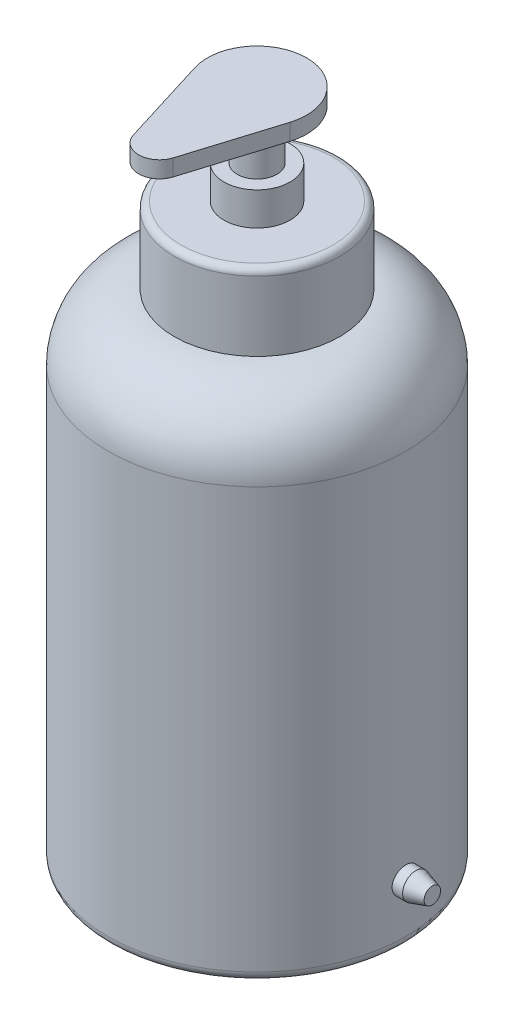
ISO-10303-21;
HEADER;
FILE_DESCRIPTION(('STEP AP214'),'2;1');
FILE_NAME('part.step','',(''),(''),'','','');
FILE_SCHEMA(('AUTOMOTIVE_DESIGN { 1 0 10303 214 1 1 1 1 }'));
ENDSEC;
DATA;
#1=APPLICATION_CONTEXT('core data for automotive mechanical design processes');
#2=APPLICATION_PROTOCOL_DEFINITION('international standard','automotive_design',2000,#1);
#3=PRODUCT_CONTEXT('',#1,'mechanical');
#4=PRODUCT('Part','Part','',(#3));
#5=PRODUCT_RELATED_PRODUCT_CATEGORY('part','',(#4));
#6=PRODUCT_DEFINITION_FORMATION('','',#4);
#7=PRODUCT_DEFINITION_CONTEXT('part definition',#1,'design');
#8=PRODUCT_DEFINITION('design','',#6,#7);
#9=PRODUCT_DEFINITION_SHAPE('','',#8);
#10=(LENGTH_UNIT() NAMED_UNIT(*) SI_UNIT(.MILLI.,.METRE.));
#11=(NAMED_UNIT(*) PLANE_ANGLE_UNIT() SI_UNIT($,.RADIAN.));
#12=(NAMED_UNIT(*) SI_UNIT($,.STERADIAN.) SOLID_ANGLE_UNIT());
#13=UNCERTAINTY_MEASURE_WITH_UNIT(LENGTH_MEASURE(1.E-05),#10,'distance_accuracy_value','');
#14=(GEOMETRIC_REPRESENTATION_CONTEXT(3) GLOBAL_UNCERTAINTY_ASSIGNED_CONTEXT((#13)) GLOBAL_UNIT_ASSIGNED_CONTEXT((#10,
#11,#12)) REPRESENTATION_CONTEXT('',''));
#15=CARTESIAN_POINT('',(0.,0.,0.));
#16=DIRECTION('',(0.,0.,1.));
#17=DIRECTION('',(1.,0.,0.));
#18=AXIS2_PLACEMENT_3D('',#15,#16,#17);
#19=CARTESIAN_POINT('',(0.,150.,0.));
#20=DIRECTION('',(0.,-1.,0.));
#21=DIRECTION('',(0.,0.,-1.));
#22=AXIS2_PLACEMENT_3D('',#19,#20,#21);
#23=CYLINDRICAL_SURFACE('',#22,45.);
#24=CARTESIAN_POINT('',(44.8218696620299,17.7484494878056,-4.));
#25=CARTESIAN_POINT('',(44.8218720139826,17.5242444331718,-3.99999023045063));
#26=CARTESIAN_POINT('',(44.8235700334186,17.2998881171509,-3.98108609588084));
#27=CARTESIAN_POINT('',(44.8301783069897,16.8573871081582,-3.90595443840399));
#28=CARTESIAN_POINT('',(44.8350921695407,16.6392496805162,-3.8496849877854));
#29=CARTESIAN_POINT('',(44.8475712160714,16.2156591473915,-3.70146645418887));
#30=CARTESIAN_POINT('',(44.8551348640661,16.0101987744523,-3.60953803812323));
#31=CARTESIAN_POINT('',(44.8720593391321,15.6176719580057,-3.39264879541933));
#32=CARTESIAN_POINT('',(44.8814197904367,15.4306016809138,-3.26769487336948));
#33=CARTESIAN_POINT('',(44.90091365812,15.0795749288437,-2.98791064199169));
#34=CARTESIAN_POINT('',(44.9110490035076,14.9156792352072,-2.83300420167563));
#35=CARTESIAN_POINT('',(44.9309330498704,14.6161766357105,-2.49787384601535));
#36=CARTESIAN_POINT('',(44.9406817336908,14.4805709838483,-2.31764880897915));
#37=CARTESIAN_POINT('',(44.9587126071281,14.241292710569,-1.93663104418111));
#38=CARTESIAN_POINT('',(44.9669923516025,14.1376731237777,-1.73580488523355));
#39=CARTESIAN_POINT('',(44.9811315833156,13.9656475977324,-1.31951843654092));
#40=CARTESIAN_POINT('',(44.9869911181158,13.8972409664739,-1.10405843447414));
#41=CARTESIAN_POINT('',(44.9956162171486,13.7977593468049,-0.665228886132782));
#42=CARTESIAN_POINT('',(44.9983899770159,13.7665854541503,-0.441881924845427));
#43=CARTESIAN_POINT('',(45.0005588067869,13.7421483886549,0.00689018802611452));
#44=CARTESIAN_POINT('',(44.9999539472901,13.7488844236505,0.232315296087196));
#45=CARTESIAN_POINT('',(44.9954404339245,13.7999953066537,0.678173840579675));
#46=CARTESIAN_POINT('',(44.9915411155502,13.8442638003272,0.898619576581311));
#47=CARTESIAN_POINT('',(44.9808878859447,13.9690175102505,1.3289395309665));
#48=CARTESIAN_POINT('',(44.9741339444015,14.0495031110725,1.53881363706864));
#49=CARTESIAN_POINT('',(44.9585150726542,14.2445242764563,1.94237021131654));
#50=CARTESIAN_POINT('',(44.9496472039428,14.3591072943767,2.13602962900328));
#51=CARTESIAN_POINT('',(44.930796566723,14.619036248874,2.50140798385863));
#52=CARTESIAN_POINT('',(44.92081377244,14.7643828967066,2.67312641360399));
#53=CARTESIAN_POINT('',(44.9008139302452,15.0823122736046,2.99037052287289));
#54=CARTESIAN_POINT('',(44.8907968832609,15.254987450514,3.13580357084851));
#55=CARTESIAN_POINT('',(44.8718921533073,15.6223506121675,3.3956324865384));
#56=CARTESIAN_POINT('',(44.8630044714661,15.8170386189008,3.51002832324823));
#57=CARTESIAN_POINT('',(44.8473634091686,16.2229679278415,3.70453297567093));
#58=CARTESIAN_POINT('',(44.8406103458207,16.4342116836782,3.7846366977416));
#59=CARTESIAN_POINT('',(44.8300094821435,16.8672237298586,3.90821321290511));
#60=CARTESIAN_POINT('',(44.8261616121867,17.0889917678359,3.95168688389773));
#61=CARTESIAN_POINT('',(44.8218183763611,17.5359458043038,4.00065138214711));
#62=CARTESIAN_POINT('',(44.8213115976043,17.7611175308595,4.00627151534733));
#63=CARTESIAN_POINT('',(44.8236778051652,18.2091997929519,3.97970839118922));
#64=CARTESIAN_POINT('',(44.8265507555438,18.4321103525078,3.94752553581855));
#65=CARTESIAN_POINT('',(44.8353423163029,18.8689696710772,3.84637790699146));
#66=CARTESIAN_POINT('',(44.8412559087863,19.0829325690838,3.77747372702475));
#67=CARTESIAN_POINT('',(44.8554583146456,19.4962613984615,3.60490106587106));
#68=CARTESIAN_POINT('',(44.8637471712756,19.6956270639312,3.50123195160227));
#69=CARTESIAN_POINT('',(44.8817938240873,20.074693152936,3.26174603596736));
#70=CARTESIAN_POINT('',(44.8915555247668,20.2543390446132,3.12584321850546));
#71=CARTESIAN_POINT('',(44.9114349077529,20.5883143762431,2.82587161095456));
#72=CARTESIAN_POINT('',(44.9215525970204,20.7426433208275,2.66180226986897));
#73=CARTESIAN_POINT('',(44.9410380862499,21.0220467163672,2.30959548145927));
#74=CARTESIAN_POINT('',(44.9504036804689,21.1470370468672,2.12139116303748));
#75=CARTESIAN_POINT('',(44.9672978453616,21.3636374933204,1.72658912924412));
#76=CARTESIAN_POINT('',(44.9748264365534,21.455247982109,1.51999161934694));
#77=CARTESIAN_POINT('',(44.9871882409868,21.6023443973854,1.09456672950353));
#78=CARTESIAN_POINT('',(44.9920253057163,21.6578819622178,0.875757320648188));
#79=CARTESIAN_POINT('',(44.9984747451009,21.7314247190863,0.431874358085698));
#80=CARTESIAN_POINT('',(45.0000871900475,21.7494307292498,0.206800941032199));
#81=CARTESIAN_POINT('',(44.9999057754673,21.7473891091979,-0.24239277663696));
#82=CARTESIAN_POINT('',(44.9981236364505,21.7274724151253,-0.466513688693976));
#83=CARTESIAN_POINT('',(44.9913764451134,21.6504242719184,-0.908213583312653));
#84=CARTESIAN_POINT('',(44.9864113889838,21.5932927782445,-1.12579255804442));
#85=CARTESIAN_POINT('',(44.9738551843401,21.4434710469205,-1.54823774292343));
#86=CARTESIAN_POINT('',(44.9662642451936,21.3507836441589,-1.7531049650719));
#87=CARTESIAN_POINT('',(44.9493045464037,21.1324957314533,-2.14439280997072));
#88=CARTESIAN_POINT('',(44.9399358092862,21.0068956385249,-2.33081366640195));
#89=CARTESIAN_POINT('',(44.9204328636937,20.7258559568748,-2.68058760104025));
#90=CARTESIAN_POINT('',(44.9102962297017,20.5703192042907,-2.84386247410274));
#91=CARTESIAN_POINT('',(44.8904206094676,20.2340033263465,-3.14205894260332));
#92=CARTESIAN_POINT('',(44.8806817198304,20.0532181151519,-3.27697368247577));
#93=CARTESIAN_POINT('',(44.8626824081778,19.6711393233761,-3.51482985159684));
#94=CARTESIAN_POINT('',(44.8544251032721,19.4698038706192,-3.6177041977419));
#95=CARTESIAN_POINT('',(44.8403615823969,19.0527783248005,-3.78805310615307));
#96=CARTESIAN_POINT('',(44.8345525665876,18.8371049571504,-3.85556812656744));
#97=CARTESIAN_POINT('',(44.827528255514,18.4748873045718,-3.93619868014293));
#98=CARTESIAN_POINT('',(44.8254161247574,18.3306684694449,-3.96009209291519));
#99=CARTESIAN_POINT('',(44.822586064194,18.0404709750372,-3.9919959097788));
#100=CARTESIAN_POINT('',(44.8218681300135,17.8944923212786,-4.00000636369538));
#101=CARTESIAN_POINT('',(44.8218696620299,17.7484494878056,-4.));
#102=B_SPLINE_CURVE_WITH_KNOTS('',3,(#24,#25,#26,#27,#28,#29,#30,#31,#32,#33,#34,#35,#36,#37,
#38,#39,#40,#41,#42,#43,#44,#45,#46,#47,#48,#49,#50,#51,#52,#53,#54,#55,#56,#57,#58,#59,#60,#61,
#62,#63,#64,#65,#66,#67,#68,#69,#70,#71,#72,#73,#74,#75,#76,#77,#78,#79,#80,#81,#82,#83,#84,#85,
#86,#87,#88,#89,#90,#91,#92,#93,#94,#95,#96,#97,#98,#99,#100,#101),.UNSPECIFIED.,.T.,.F.,(4,2,2,
2,2,2,2,2,2,2,2,2,2,2,2,2,2,2,2,2,2,2,2,2,2,2,2,2,2,2,2,2,2,2,2,2,2,2,4),(0.,0.672081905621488,
1.34491923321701,2.01736718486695,2.68967465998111,3.36371396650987,4.03778314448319,
4.7129640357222,5.38813165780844,6.06150176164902,6.73485779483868,7.40631211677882,
8.07777356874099,8.75017389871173,9.42258977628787,10.097330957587,10.7720728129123,
11.4469148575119,12.1217407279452,12.7942602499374,13.4667726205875,14.1381787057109,
14.8095970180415,15.4828275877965,16.1560713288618,16.8312224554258,17.5063660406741,
18.1805410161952,18.8547012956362,19.526538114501,20.1983757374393,20.8701598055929,
21.5419353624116,22.2159291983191,22.8900857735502,23.5656444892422,24.2404285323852,
24.6782110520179,25.1159921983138),.UNSPECIFIED.);
#103=CARTESIAN_POINT('',(44.8218696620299,17.7484494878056,-4.));
#104=VERTEX_POINT('',#103);
#105=EDGE_CURVE('E122',#104,#104,#102,.T.);
#106=ORIENTED_EDGE('',*,*,#105,.T.);
#107=EDGE_LOOP('',(#106));
#108=FACE_BOUND('',#107,.T.);
#109=CARTESIAN_POINT('',(0.,130.,0.));
#110=DIRECTION('',(0.,1.,0.));
#111=DIRECTION('',(0.,0.,1.));
#112=AXIS2_PLACEMENT_3D('',#109,#110,#111);
#113=CIRCLE('',#112,45.);
#114=CARTESIAN_POINT('',(0.,130.,45.));
#115=VERTEX_POINT('',#114);
#116=EDGE_CURVE('E159',#115,#115,#113,.F.);
#117=ORIENTED_EDGE('',*,*,#116,.T.);
#118=EDGE_LOOP('',(#117));
#119=FACE_BOUND('',#118,.T.);
#120=CARTESIAN_POINT('',(0.,3.,0.));
#121=DIRECTION('',(0.,1.,0.));
#122=DIRECTION('',(0.,0.,1.));
#123=AXIS2_PLACEMENT_3D('',#120,#121,#122);
#124=CIRCLE('',#123,45.);
#125=CARTESIAN_POINT('',(0.,3.,45.));
#126=VERTEX_POINT('',#125);
#127=EDGE_CURVE('E144',#126,#126,#124,.T.);
#128=ORIENTED_EDGE('',*,*,#127,.T.);
#129=EDGE_LOOP('',(#128));
#130=FACE_BOUND('',#129,.T.);
#131=ADVANCED_FACE('F43',(#108,#119,#130),#23,.T.);
#132=CARTESIAN_POINT('',(0.,0.,0.));
#133=DIRECTION('',(0.,1.,0.));
#134=DIRECTION('',(0.,0.,1.));
#135=AXIS2_PLACEMENT_3D('',#132,#133,#134);
#136=PLANE('',#135);
#137=CARTESIAN_POINT('',(0.,0.,0.));
#138=DIRECTION('',(0.,1.,0.));
#139=DIRECTION('',(0.,0.,1.));
#140=AXIS2_PLACEMENT_3D('',#137,#138,#139);
#141=CIRCLE('',#140,42.);
#142=CARTESIAN_POINT('',(0.,0.,42.));
#143=VERTEX_POINT('',#142);
#144=EDGE_CURVE('E151',#143,#143,#141,.F.);
#145=ORIENTED_EDGE('',*,*,#144,.T.);
#146=EDGE_LOOP('',(#145));
#147=FACE_BOUND('',#146,.T.);
#148=ADVANCED_FACE('F228',(#147),#136,.F.);
#149=CARTESIAN_POINT('',(0.,3.,0.));
#150=DIRECTION('',(0.,1.,0.));
#151=DIRECTION('',(0.,0.,1.));
#152=AXIS2_PLACEMENT_3D('',#149,#150,#151);
#153=TOROIDAL_SURFACE('',#152,42.,3.);
#154=ORIENTED_EDGE('',*,*,#144,.F.);
#155=EDGE_LOOP('',(#154));
#156=FACE_BOUND('',#155,.T.);
#157=ORIENTED_EDGE('',*,*,#127,.F.);
#158=EDGE_LOOP('',(#157));
#159=FACE_BOUND('',#158,.T.);
#160=ADVANCED_FACE('F230',(#156,#159),#153,.T.);
#161=CARTESIAN_POINT('',(0.,130.,0.));
#162=DIRECTION('',(0.,1.,0.));
#163=DIRECTION('',(0.,0.,1.));
#164=AXIS2_PLACEMENT_3D('',#161,#162,#163);
#165=TOROIDAL_SURFACE('',#164,25.,20.);
#166=ORIENTED_EDGE('',*,*,#116,.F.);
#167=EDGE_LOOP('',(#166));
#168=FACE_BOUND('',#167,.T.);
#169=CARTESIAN_POINT('',(0.,150.,0.));
#170=DIRECTION('',(0.,1.,0.));
#171=DIRECTION('',(0.,0.,1.));
#172=AXIS2_PLACEMENT_3D('',#169,#170,#171);
#173=CIRCLE('',#172,25.);
#174=CARTESIAN_POINT('',(0.,150.,25.));
#175=VERTEX_POINT('',#174);
#176=EDGE_CURVE('E155',#175,#175,#173,.T.);
#177=ORIENTED_EDGE('',*,*,#176,.F.);
#178=EDGE_LOOP('',(#177));
#179=FACE_BOUND('',#178,.T.);
#180=ADVANCED_FACE('F226',(#168,#179),#165,.T.);
#181=CARTESIAN_POINT('',(0.,173.,0.));
#182=DIRECTION('',(0.,-1.,0.));
#183=DIRECTION('',(0.,0.,-1.));
#184=AXIS2_PLACEMENT_3D('',#181,#182,#183);
#185=CYLINDRICAL_SURFACE('',#184,25.);
#186=CARTESIAN_POINT('',(0.,171.,0.));
#187=DIRECTION('',(0.,1.,0.));
#188=DIRECTION('',(0.,0.,1.));
#189=AXIS2_PLACEMENT_3D('',#186,#187,#188);
#190=CIRCLE('',#189,25.);
#191=CARTESIAN_POINT('',(0.,171.,25.));
#192=VERTEX_POINT('',#191);
#193=EDGE_CURVE('E54',#192,#192,#190,.F.);
#194=ORIENTED_EDGE('',*,*,#193,.T.);
#195=EDGE_LOOP('',(#194));
#196=FACE_BOUND('',#195,.T.);
#197=ORIENTED_EDGE('',*,*,#176,.T.);
#198=EDGE_LOOP('',(#197));
#199=FACE_BOUND('',#198,.T.);
#200=ADVANCED_FACE('F223',(#196,#199),#185,.T.);
#201=CARTESIAN_POINT('',(0.,173.,0.));
#202=DIRECTION('',(0.,1.,0.));
#203=DIRECTION('',(0.,0.,1.));
#204=AXIS2_PLACEMENT_3D('',#201,#202,#203);
#205=PLANE('',#204);
#206=CARTESIAN_POINT('',(0.,173.,0.));
#207=DIRECTION('',(0.,1.,0.));
#208=DIRECTION('',(0.,0.,1.));
#209=AXIS2_PLACEMENT_3D('',#206,#207,#208);
#210=CIRCLE('',#209,10.);
#211=CARTESIAN_POINT('',(0.,173.,10.));
#212=VERTEX_POINT('',#211);
#213=EDGE_CURVE('E138',#212,#212,#210,.T.);
#214=ORIENTED_EDGE('',*,*,#213,.F.);
#215=EDGE_LOOP('',(#214));
#216=FACE_BOUND('',#215,.T.);
#217=CARTESIAN_POINT('',(0.,173.,0.));
#218=DIRECTION('',(0.,1.,0.));
#219=DIRECTION('',(0.,0.,1.));
#220=AXIS2_PLACEMENT_3D('',#217,#218,#219);
#221=CIRCLE('',#220,23.);
#222=CARTESIAN_POINT('',(0.,173.,23.));
#223=VERTEX_POINT('',#222);
#224=EDGE_CURVE('E163',#223,#223,#221,.T.);
#225=ORIENTED_EDGE('',*,*,#224,.T.);
#226=EDGE_LOOP('',(#225));
#227=FACE_BOUND('',#226,.T.);
#228=ADVANCED_FACE('F220',(#216,#227),#205,.T.);
#229=CARTESIAN_POINT('',(0.,171.,0.));
#230=DIRECTION('',(0.,1.,0.));
#231=DIRECTION('',(0.,0.,1.));
#232=AXIS2_PLACEMENT_3D('',#229,#230,#231);
#233=TOROIDAL_SURFACE('',#232,23.,2.);
#234=ORIENTED_EDGE('',*,*,#193,.F.);
#235=EDGE_LOOP('',(#234));
#236=FACE_BOUND('',#235,.T.);
#237=ORIENTED_EDGE('',*,*,#224,.F.);
#238=EDGE_LOOP('',(#237));
#239=FACE_BOUND('',#238,.T.);
#240=ADVANCED_FACE('F45',(#236,#239),#233,.T.);
#241=CARTESIAN_POINT('',(0.,183.,0.));
#242=DIRECTION('',(0.,-1.,0.));
#243=DIRECTION('',(0.,0.,-1.));
#244=AXIS2_PLACEMENT_3D('',#241,#242,#243);
#245=CYLINDRICAL_SURFACE('',#244,10.);
#246=CARTESIAN_POINT('',(0.,183.,0.));
#247=DIRECTION('',(0.,1.,0.));
#248=DIRECTION('',(0.,0.,1.));
#249=AXIS2_PLACEMENT_3D('',#246,#247,#248);
#250=CIRCLE('',#249,10.);
#251=CARTESIAN_POINT('',(0.,183.,10.));
#252=VERTEX_POINT('',#251);
#253=EDGE_CURVE('E140',#252,#252,#250,.T.);
#254=ORIENTED_EDGE('',*,*,#253,.F.);
#255=EDGE_LOOP('',(#254));
#256=FACE_BOUND('',#255,.T.);
#257=ORIENTED_EDGE('',*,*,#213,.T.);
#258=EDGE_LOOP('',(#257));
#259=FACE_BOUND('',#258,.T.);
#260=ADVANCED_FACE('F215',(#256,#259),#245,.T.);
#261=CARTESIAN_POINT('',(0.,183.,0.));
#262=DIRECTION('',(0.,1.,0.));
#263=DIRECTION('',(0.,0.,1.));
#264=AXIS2_PLACEMENT_3D('',#261,#262,#263);
#265=PLANE('',#264);
#266=CARTESIAN_POINT('',(0.,183.,0.));
#267=DIRECTION('',(0.,1.,0.));
#268=DIRECTION('',(0.,0.,1.));
#269=AXIS2_PLACEMENT_3D('',#266,#267,#268);
#270=CIRCLE('',#269,6.);
#271=CARTESIAN_POINT('',(0.,183.,6.));
#272=VERTEX_POINT('',#271);
#273=EDGE_CURVE('E12',#272,#272,#270,.T.);
#274=ORIENTED_EDGE('',*,*,#273,.F.);
#275=EDGE_LOOP('',(#274));
#276=FACE_BOUND('',#275,.T.);
#277=ORIENTED_EDGE('',*,*,#253,.T.);
#278=EDGE_LOOP('',(#277));
#279=FACE_BOUND('',#278,.T.);
#280=ADVANCED_FACE('F211',(#276,#279),#265,.T.);
#281=CARTESIAN_POINT('',(0.,198.,0.));
#282=DIRECTION('',(0.,-1.,0.));
#283=DIRECTION('',(0.,0.,-1.));
#284=AXIS2_PLACEMENT_3D('',#281,#282,#283);
#285=CYLINDRICAL_SURFACE('',#284,6.);
#286=CARTESIAN_POINT('',(0.,198.,0.));
#287=DIRECTION('',(0.,1.,0.));
#288=DIRECTION('',(0.,0.,1.));
#289=AXIS2_PLACEMENT_3D('',#286,#287,#288);
#290=CIRCLE('',#289,6.);
#291=CARTESIAN_POINT('',(0.,198.,6.));
#292=VERTEX_POINT('',#291);
#293=EDGE_CURVE('E135',#292,#292,#290,.T.);
#294=ORIENTED_EDGE('',*,*,#293,.F.);
#295=EDGE_LOOP('',(#294));
#296=FACE_BOUND('',#295,.T.);
#297=ORIENTED_EDGE('',*,*,#273,.T.);
#298=EDGE_LOOP('',(#297));
#299=FACE_BOUND('',#298,.T.);
#300=ADVANCED_FACE('F207',(#296,#299),#285,.T.);
#301=CARTESIAN_POINT('',(0.,203.,29.4836966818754));
#302=DIRECTION('',(0.,-1.,0.));
#303=DIRECTION('',(0.,0.,-1.));
#304=AXIS2_PLACEMENT_3D('',#301,#302,#303);
#305=CYLINDRICAL_SURFACE('',#304,6.29439749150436);
#306=CARTESIAN_POINT('',(0.,198.,29.4836966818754));
#307=DIRECTION('',(0.,1.,0.));
#308=DIRECTION('',(0.,0.,1.));
#309=AXIS2_PLACEMENT_3D('',#306,#307,#308);
#310=CIRCLE('',#309,6.29439749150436);
#311=CARTESIAN_POINT('',(-6.01375775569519,198.,31.3422330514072));
#312=VERTEX_POINT('',#311);
#313=CARTESIAN_POINT('',(6.01375775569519,198.,31.3422330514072));
#314=VERTEX_POINT('',#313);
#315=EDGE_CURVE('E118',#312,#314,#310,.T.);
#316=ORIENTED_EDGE('',*,*,#315,.T.);
#317=DIRECTION('',(0.,-1.,0.));
#318=VECTOR('',#317,1.);
#319=CARTESIAN_POINT('',(6.01375775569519,203.,31.3422330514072));
#320=LINE('',#319,#318);
#321=CARTESIAN_POINT('',(6.01375775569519,203.,31.3422330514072));
#322=VERTEX_POINT('',#321);
#323=EDGE_CURVE('E107',#322,#314,#320,.T.);
#324=ORIENTED_EDGE('',*,*,#323,.F.);
#325=CARTESIAN_POINT('',(0.,203.,29.4836966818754));
#326=DIRECTION('',(0.,1.,0.));
#327=DIRECTION('',(0.,0.,1.));
#328=AXIS2_PLACEMENT_3D('',#325,#326,#327);
#329=CIRCLE('',#328,6.29439749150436);
#330=CARTESIAN_POINT('',(-6.01375775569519,203.,31.3422330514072));
#331=VERTEX_POINT('',#330);
#332=EDGE_CURVE('E99',#331,#322,#329,.T.);
#333=ORIENTED_EDGE('',*,*,#332,.F.);
#334=DIRECTION('',(0.,-1.,0.));
#335=VECTOR('',#334,1.);
#336=CARTESIAN_POINT('',(-6.01375775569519,203.,31.3422330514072));
#337=LINE('',#336,#335);
#338=EDGE_CURVE('E114',#331,#312,#337,.T.);
#339=ORIENTED_EDGE('',*,*,#338,.T.);
#340=EDGE_LOOP('',(#316,#324,#333,#339));
#341=FACE_BOUND('',#340,.T.);
#342=ADVANCED_FACE('F204',(#341),#305,.T.);
#343=CARTESIAN_POINT('',(6.01375775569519,203.,31.3422330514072));
#344=DIRECTION('',(-0.955414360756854,0.,-0.295268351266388));
#345=DIRECTION('',(-0.295268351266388,0.,0.955414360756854));
#346=AXIS2_PLACEMENT_3D('',#343,#344,#345);
#347=PLANE('',#346);
#348=DIRECTION('',(0.295268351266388,0.,-0.955414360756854));
#349=VECTOR('',#348,1.);
#350=CARTESIAN_POINT('',(6.01375775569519,198.,31.3422330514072));
#351=LINE('',#350,#349);
#352=CARTESIAN_POINT('',(14.3312154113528,198.,4.42902526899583));
#353=VERTEX_POINT('',#352);
#354=EDGE_CURVE('E105',#314,#353,#351,.T.);
#355=ORIENTED_EDGE('',*,*,#354,.T.);
#356=DIRECTION('',(0.,-1.,0.));
#357=VECTOR('',#356,1.);
#358=CARTESIAN_POINT('',(14.3312154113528,203.,4.42902526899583));
#359=LINE('',#358,#357);
#360=CARTESIAN_POINT('',(14.3312154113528,203.,4.42902526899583));
#361=VERTEX_POINT('',#360);
#362=EDGE_CURVE('E103',#361,#353,#359,.T.);
#363=ORIENTED_EDGE('',*,*,#362,.F.);
#364=DIRECTION('',(0.295268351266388,0.,-0.955414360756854));
#365=VECTOR('',#364,1.);
#366=CARTESIAN_POINT('',(6.01375775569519,203.,31.3422330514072));
#367=LINE('',#366,#365);
#368=EDGE_CURVE('E94',#322,#361,#367,.T.);
#369=ORIENTED_EDGE('',*,*,#368,.F.);
#370=ORIENTED_EDGE('',*,*,#323,.T.);
#371=EDGE_LOOP('',(#355,#363,#369,#370));
#372=FACE_BOUND('',#371,.T.);
#373=ADVANCED_FACE('F104',(#372),#347,.F.);
#374=CARTESIAN_POINT('',(0.,203.,0.));
#375=DIRECTION('',(0.,-1.,0.));
#376=DIRECTION('',(0.,0.,-1.));
#377=AXIS2_PLACEMENT_3D('',#374,#375,#376);
#378=CYLINDRICAL_SURFACE('',#377,15.);
#379=CARTESIAN_POINT('',(0.,198.,0.));
#380=DIRECTION('',(0.,1.,0.));
#381=DIRECTION('',(0.,0.,1.));
#382=AXIS2_PLACEMENT_3D('',#379,#380,#381);
#383=CIRCLE('',#382,15.);
#384=CARTESIAN_POINT('',(-14.3312154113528,198.,4.42902526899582));
#385=VERTEX_POINT('',#384);
#386=EDGE_CURVE('E80',#353,#385,#383,.T.);
#387=ORIENTED_EDGE('',*,*,#386,.T.);
#388=DIRECTION('',(0.,-1.,0.));
#389=VECTOR('',#388,1.);
#390=CARTESIAN_POINT('',(-14.3312154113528,203.,4.42902526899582));
#391=LINE('',#390,#389);
#392=CARTESIAN_POINT('',(-14.3312154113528,203.,4.42902526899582));
#393=VERTEX_POINT('',#392);
#394=EDGE_CURVE('E108',#393,#385,#391,.T.);
#395=ORIENTED_EDGE('',*,*,#394,.F.);
#396=CARTESIAN_POINT('',(0.,203.,0.));
#397=DIRECTION('',(0.,1.,0.));
#398=DIRECTION('',(0.,0.,1.));
#399=AXIS2_PLACEMENT_3D('',#396,#397,#398);
#400=CIRCLE('',#399,15.);
#401=EDGE_CURVE('E97',#361,#393,#400,.T.);
#402=ORIENTED_EDGE('',*,*,#401,.F.);
#403=ORIENTED_EDGE('',*,*,#362,.T.);
#404=EDGE_LOOP('',(#387,#395,#402,#403));
#405=FACE_BOUND('',#404,.T.);
#406=ADVANCED_FACE('F110',(#405),#378,.T.);
#407=CARTESIAN_POINT('',(-6.01375775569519,203.,31.3422330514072));
#408=DIRECTION('',(0.955414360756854,0.,-0.295268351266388));
#409=DIRECTION('',(-0.295268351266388,0.,-0.955414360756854));
#410=AXIS2_PLACEMENT_3D('',#407,#408,#409);
#411=PLANE('',#410);
#412=DIRECTION('',(0.295268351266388,0.,0.955414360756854));
#413=VECTOR('',#412,1.);
#414=CARTESIAN_POINT('',(-6.01375775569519,198.,31.3422330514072));
#415=LINE('',#414,#413);
#416=EDGE_CURVE('E86',#385,#312,#415,.T.);
#417=ORIENTED_EDGE('',*,*,#416,.T.);
#418=ORIENTED_EDGE('',*,*,#338,.F.);
#419=DIRECTION('',(0.295268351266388,0.,0.955414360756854));
#420=VECTOR('',#419,1.);
#421=CARTESIAN_POINT('',(-6.01375775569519,203.,31.3422330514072));
#422=LINE('',#421,#420);
#423=EDGE_CURVE('E63',#393,#331,#422,.T.);
#424=ORIENTED_EDGE('',*,*,#423,.F.);
#425=ORIENTED_EDGE('',*,*,#394,.T.);
#426=EDGE_LOOP('',(#417,#418,#424,#425));
#427=FACE_BOUND('',#426,.T.);
#428=ADVANCED_FACE('F194',(#427),#411,.F.);
#429=CARTESIAN_POINT('',(0.,203.,29.4836966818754));
#430=DIRECTION('',(0.,1.,0.));
#431=DIRECTION('',(0.,0.,1.));
#432=AXIS2_PLACEMENT_3D('',#429,#430,#431);
#433=PLANE('',#432);
#434=ORIENTED_EDGE('',*,*,#332,.T.);
#435=ORIENTED_EDGE('',*,*,#368,.T.);
#436=ORIENTED_EDGE('',*,*,#401,.T.);
#437=ORIENTED_EDGE('',*,*,#423,.T.);
#438=EDGE_LOOP('',(#434,#435,#436,#437));
#439=FACE_BOUND('',#438,.T.);
#440=ADVANCED_FACE('F95',(#439),#433,.T.);
#441=CARTESIAN_POINT('',(0.,198.,29.4836966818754));
#442=DIRECTION('',(0.,1.,0.));
#443=DIRECTION('',(0.,0.,1.));
#444=AXIS2_PLACEMENT_3D('',#441,#442,#443);
#445=PLANE('',#444);
#446=ORIENTED_EDGE('',*,*,#293,.T.);
#447=EDGE_LOOP('',(#446));
#448=FACE_BOUND('',#447,.T.);
#449=ORIENTED_EDGE('',*,*,#315,.F.);
#450=ORIENTED_EDGE('',*,*,#416,.F.);
#451=ORIENTED_EDGE('',*,*,#386,.F.);
#452=ORIENTED_EDGE('',*,*,#354,.F.);
#453=EDGE_LOOP('',(#449,#450,#451,#452));
#454=FACE_BOUND('',#453,.T.);
#455=ADVANCED_FACE('F187',(#448,#454),#445,.F.);
#456=CARTESIAN_POINT('',(44.,17.7484494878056,0.));
#457=DIRECTION('',(1.,0.,0.));
#458=DIRECTION('',(0.,0.,-1.));
#459=AXIS2_PLACEMENT_3D('',#456,#457,#458);
#460=CYLINDRICAL_SURFACE('',#459,4.);
#461=CARTESIAN_POINT('',(48.,17.7484494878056,0.));
#462=DIRECTION('',(-1.,0.,0.));
#463=DIRECTION('',(0.,0.,1.));
#464=AXIS2_PLACEMENT_3D('',#461,#462,#463);
#465=CIRCLE('',#464,4.);
#466=CARTESIAN_POINT('',(48.,17.7484494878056,4.));
#467=VERTEX_POINT('',#466);
#468=EDGE_CURVE('E177',#467,#467,#465,.F.);
#469=ORIENTED_EDGE('',*,*,#468,.F.);
#470=EDGE_LOOP('',(#469));
#471=FACE_BOUND('',#470,.T.);
#472=ORIENTED_EDGE('',*,*,#105,.F.);
#473=EDGE_LOOP('',(#472));
#474=FACE_BOUND('',#473,.T.);
#475=ADVANCED_FACE('F181',(#471,#474),#460,.T.);
#476=CARTESIAN_POINT('',(53.,17.7484494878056,0.));
#477=DIRECTION('',(1.,0.,0.));
#478=DIRECTION('',(0.,0.,-1.));
#479=AXIS2_PLACEMENT_3D('',#476,#477,#478);
#480=PLANE('',#479);
#481=CARTESIAN_POINT('',(53.,17.7484494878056,0.));
#482=DIRECTION('',(1.,0.,0.));
#483=DIRECTION('',(0.,0.,-1.));
#484=AXIS2_PLACEMENT_3D('',#481,#482,#483);
#485=CIRCLE('',#484,2.5);
#486=CARTESIAN_POINT('',(53.,17.7484494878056,-2.5));
#487=VERTEX_POINT('',#486);
#488=EDGE_CURVE('E335',#487,#487,#485,.T.);
#489=ORIENTED_EDGE('',*,*,#488,.T.);
#490=EDGE_LOOP('',(#489));
#491=FACE_BOUND('',#490,.T.);
#492=ADVANCED_FACE('F186',(#491),#480,.T.);
#493=CARTESIAN_POINT('',(53.,17.7484494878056,0.));
#494=DIRECTION('',(-1.,0.,0.));
#495=DIRECTION('',(0.,0.,1.));
#496=AXIS2_PLACEMENT_3D('',#493,#494,#495);
#497=CONICAL_SURFACE('',#496,2.5,0.291456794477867);
#498=ORIENTED_EDGE('',*,*,#468,.T.);
#499=EDGE_LOOP('',(#498));
#500=FACE_BOUND('',#499,.T.);
#501=ORIENTED_EDGE('',*,*,#488,.F.);
#502=EDGE_LOOP('',(#501));
#503=FACE_BOUND('',#502,.T.);
#504=ADVANCED_FACE('F189',(#500,#503),#497,.T.);
#505=CLOSED_SHELL('',(#131,#148,#160,#180,#200,#228,#240,#260,#280,#300,#342,#373,#406,#428,
#440,#455,#475,#492,#504));
#506=MANIFOLD_SOLID_BREP('B2',#505);
#507=ADVANCED_BREP_SHAPE_REPRESENTATION('',(#18,#506),#14);
#508=SHAPE_DEFINITION_REPRESENTATION(#9,#507);
ENDSEC;
END-ISO-10303-21;
